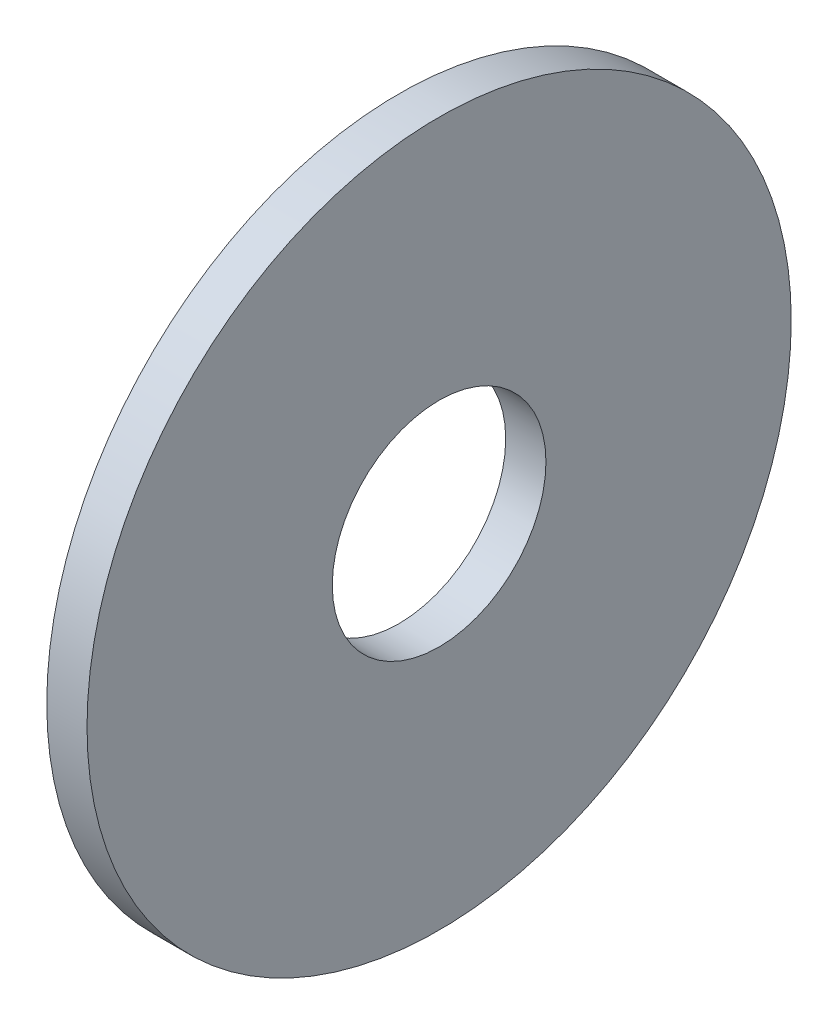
from build123d import *

# Parameters (mm, degrees)
SKETCH1_W = 2.54
SKETCH1_H = 15.4813


with BuildPart() as part:
    # Sketch1 → Base-Revolve (revolve)
    with BuildSketch(Plane.XY, mode=Mode.PRIVATE) as base_revolve_sk:
        with Locations((-1.27, 14.48435)):
            Rectangle(SKETCH1_W, SKETCH1_H)
    revolve(base_revolve_sk.sketch.rotate(Axis((-34.925, 0, 0), (1, 0, 0)), 90), axis=Axis((-34.925, 0, 0), (1, 0, 0)))


solid = part.part
